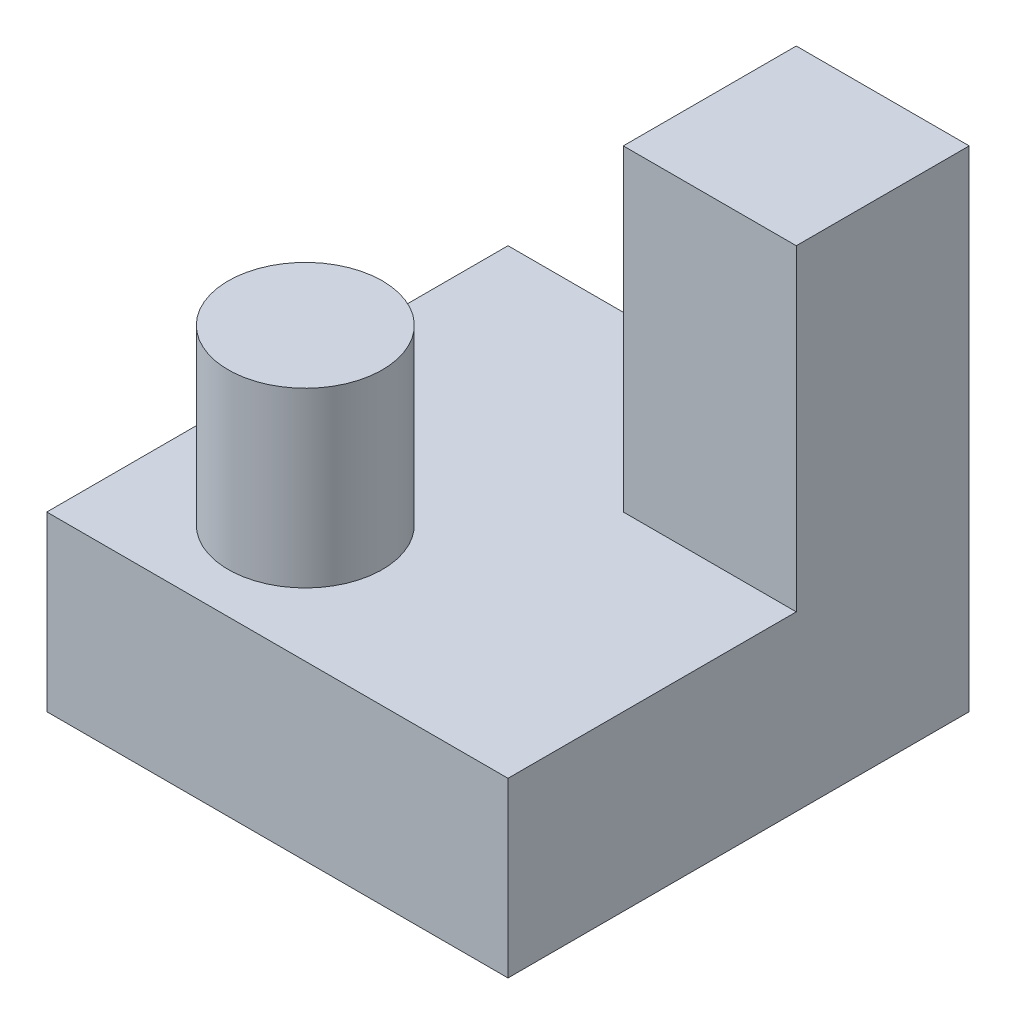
from build123d import *

# Parameters (mm, degrees)
SKETCH1_W      = 101.6
SKETCH1_H      = 101.6
EXTRUDE1_DEPTH = 38.1
SKETCH3_R      = 16.983953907
EXTRUDE2_DEPTH = 38.1
SKETCH4_W      = 38.1
SKETCH4_H      = 38.1
EXTRUDE3_DEPTH = 69.85


with BuildPart() as part:
    # Sketch1 → Extrude1 (new body)
    with BuildSketch(Plane(origin=(0, 0, 0), x_dir=(1, 0, 0), z_dir=(0, 1, 0))):
        with Locations((50.8, 50.8)):
            Rectangle(SKETCH1_W, SKETCH1_H)
    extrude(amount=EXTRUDE1_DEPTH)

    # Sketch3 → Extrude2 (add)
    with BuildSketch(Plane(origin=(0, 38.1, 0), x_dir=(1, 0, 0), z_dir=(0, 1, 0))):
        with Locations(Location((30.963637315, 25.987663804, 0), (0, 0, 90))):
            Circle(SKETCH3_R)
    extrude(amount=EXTRUDE2_DEPTH)

    # Sketch4 → Extrude3 (add)
    with BuildSketch(Plane(origin=(0, 38.1, 0), x_dir=(1, 0, 0), z_dir=(0, 1, 0))):
        with Locations((82.55, 82.55)):
            Rectangle(SKETCH4_W, SKETCH4_H)
    extrude(amount=EXTRUDE3_DEPTH)


solid = part.part
